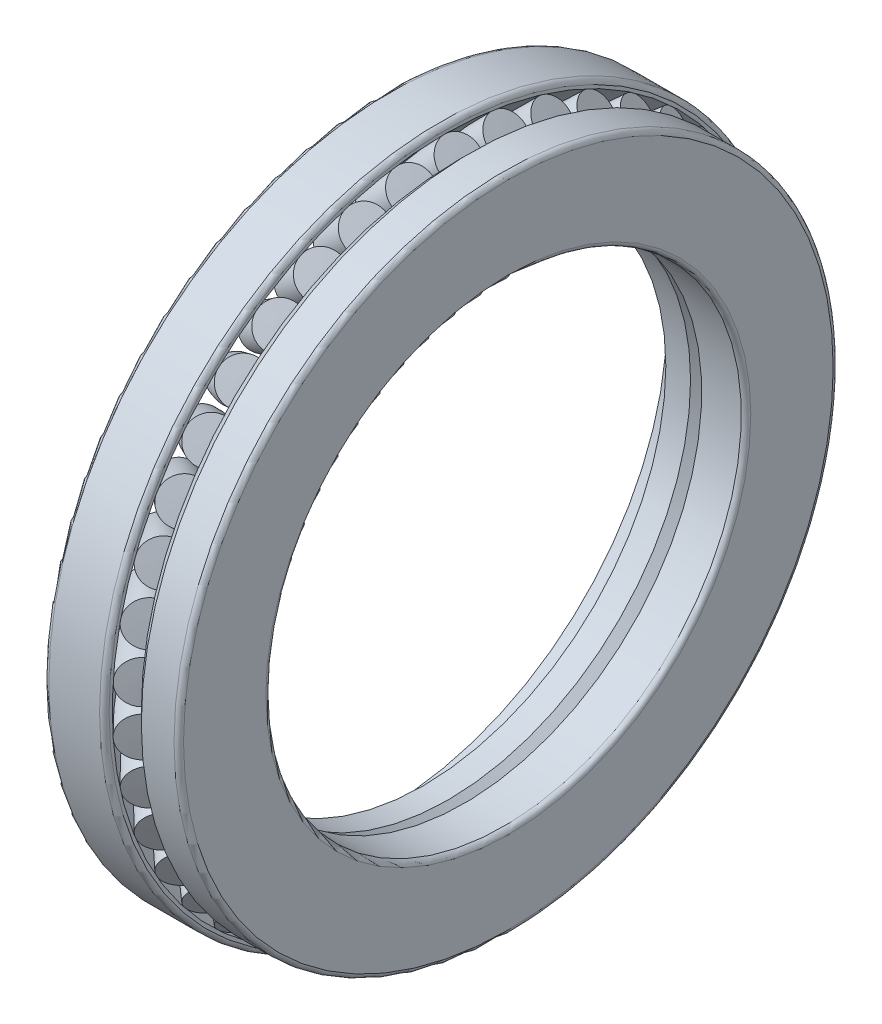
from build123d import *

# Parameters (mm, degrees)
CIRCULAR_PATTERN1_COUNT = 42


with BuildPart() as part:
    # Sketch1 → Revolve1 (revolve)
    with BuildSketch(Plane.XY, mode=Mode.PRIVATE) as revolve1_sk:
        with BuildLine():
            Line((-1, 106), (-1, 105))
            ThreePointArc((-1, 105), (-8.404844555, 97.260372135), (-15.223921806, 89))
            Line((-15.223921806, 89), (-20, 89))
            Line((-20, 89), (-20, 106))
            ThreePointArc((-20, 106), (-19.560660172, 107.060660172), (-18.5, 107.5))
            Line((-18.5, 107.5), (-2.5, 107.5))
            ThreePointArc((-2.5, 107.5), (-1.439339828, 107.060660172), (-1, 106))
        make_face()
    revolve(revolve1_sk.sketch.rotate(Axis((-62.403103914, 0, 0), (1, 0, 0)), 90), axis=Axis((-62.403103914, 0, 0), (1, 0, 0)))


with BuildPart() as body_2:
    # Sketch2 → Revolve2 (revolve)
    with BuildSketch(Plane.XY, mode=Mode.PRIVATE) as revolve2_sk:
        with BuildLine():
            Line((3.596194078, 100.403805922), (-9.239420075, 87.56819177))
            Line((-9.239420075, 87.56819177), (-13.223921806, 91.552693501))
            ThreePointArc((-13.223921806, 91.552693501), (-7.352309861, 98.431585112), (-1.067114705, 104.934761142))
            Line((-1.067114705, 104.934761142), (3.596194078, 100.403805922))
        make_face()
    revolve(revolve2_sk.sketch.rotate(Axis((-9.239420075, 87.56819177, 0), (0.7071067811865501, 0.7071067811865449, 0)), 180), axis=Axis((-9.239420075, 87.56819177, 0), (0.7071067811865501, 0.7071067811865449, 0)))


with BuildPart() as circular_pattern1_1:
    # Circular-Pattern1: pattern copy
    add(body_2.part.rotate(Axis((0, 0, 0), (1, 0, 0)), 1 * 360 / CIRCULAR_PATTERN1_COUNT))


with BuildPart() as circular_pattern1_2:
    # Circular-Pattern1: pattern copy
    add(body_2.part.rotate(Axis((0, 0, 0), (1, 0, 0)), 2 * 360 / CIRCULAR_PATTERN1_COUNT))


with BuildPart() as circular_pattern1_3:
    # Circular-Pattern1: pattern copy
    add(body_2.part.rotate(Axis((0, 0, 0), (1, 0, 0)), 3 * 360 / CIRCULAR_PATTERN1_COUNT))


with BuildPart() as circular_pattern1_4:
    # Circular-Pattern1: pattern copy
    add(body_2.part.rotate(Axis((0, 0, 0), (1, 0, 0)), 4 * 360 / CIRCULAR_PATTERN1_COUNT))


with BuildPart() as circular_pattern1_5:
    # Circular-Pattern1: pattern copy
    add(body_2.part.rotate(Axis((0, 0, 0), (1, 0, 0)), 5 * 360 / CIRCULAR_PATTERN1_COUNT))


with BuildPart() as circular_pattern1_6:
    # Circular-Pattern1: pattern copy
    add(body_2.part.rotate(Axis((0, 0, 0), (1, 0, 0)), 6 * 360 / CIRCULAR_PATTERN1_COUNT))


with BuildPart() as circular_pattern1_7:
    # Circular-Pattern1: pattern copy
    add(body_2.part.rotate(Axis((0, 0, 0), (1, 0, 0)), 7 * 360 / CIRCULAR_PATTERN1_COUNT))


with BuildPart() as circular_pattern1_8:
    # Circular-Pattern1: pattern copy
    add(body_2.part.rotate(Axis((0, 0, 0), (1, 0, 0)), 8 * 360 / CIRCULAR_PATTERN1_COUNT))


with BuildPart() as circular_pattern1_9:
    # Circular-Pattern1: pattern copy
    add(body_2.part.rotate(Axis((0, 0, 0), (1, 0, 0)), 9 * 360 / CIRCULAR_PATTERN1_COUNT))


with BuildPart() as circular_pattern1_10:
    # Circular-Pattern1: pattern copy
    add(body_2.part.rotate(Axis((0, 0, 0), (1, 0, 0)), 10 * 360 / CIRCULAR_PATTERN1_COUNT))


with BuildPart() as circular_pattern1_11:
    # Circular-Pattern1: pattern copy
    add(body_2.part.rotate(Axis((0, 0, 0), (1, 0, 0)), 11 * 360 / CIRCULAR_PATTERN1_COUNT))


with BuildPart() as circular_pattern1_12:
    # Circular-Pattern1: pattern copy
    add(body_2.part.rotate(Axis((0, 0, 0), (1, 0, 0)), 12 * 360 / CIRCULAR_PATTERN1_COUNT))


with BuildPart() as circular_pattern1_13:
    # Circular-Pattern1: pattern copy
    add(body_2.part.rotate(Axis((0, 0, 0), (1, 0, 0)), 13 * 360 / CIRCULAR_PATTERN1_COUNT))


with BuildPart() as circular_pattern1_14:
    # Circular-Pattern1: pattern copy
    add(body_2.part.rotate(Axis((0, 0, 0), (1, 0, 0)), 14 * 360 / CIRCULAR_PATTERN1_COUNT))


with BuildPart() as circular_pattern1_15:
    # Circular-Pattern1: pattern copy
    add(body_2.part.rotate(Axis((0, 0, 0), (1, 0, 0)), 15 * 360 / CIRCULAR_PATTERN1_COUNT))


with BuildPart() as circular_pattern1_16:
    # Circular-Pattern1: pattern copy
    add(body_2.part.rotate(Axis((0, 0, 0), (1, 0, 0)), 16 * 360 / CIRCULAR_PATTERN1_COUNT))


with BuildPart() as circular_pattern1_17:
    # Circular-Pattern1: pattern copy
    add(body_2.part.rotate(Axis((0, 0, 0), (1, 0, 0)), 17 * 360 / CIRCULAR_PATTERN1_COUNT))


with BuildPart() as circular_pattern1_18:
    # Circular-Pattern1: pattern copy
    add(body_2.part.rotate(Axis((0, 0, 0), (1, 0, 0)), 18 * 360 / CIRCULAR_PATTERN1_COUNT))


with BuildPart() as circular_pattern1_19:
    # Circular-Pattern1: pattern copy
    add(body_2.part.rotate(Axis((0, 0, 0), (1, 0, 0)), 19 * 360 / CIRCULAR_PATTERN1_COUNT))


with BuildPart() as circular_pattern1_20:
    # Circular-Pattern1: pattern copy
    add(body_2.part.rotate(Axis((0, 0, 0), (1, 0, 0)), 20 * 360 / CIRCULAR_PATTERN1_COUNT))


with BuildPart() as circular_pattern1_21:
    # Circular-Pattern1: pattern copy
    add(body_2.part.rotate(Axis((0, 0, 0), (1, 0, 0)), 21 * 360 / CIRCULAR_PATTERN1_COUNT))


with BuildPart() as circular_pattern1_22:
    # Circular-Pattern1: pattern copy
    add(body_2.part.rotate(Axis((0, 0, 0), (1, 0, 0)), 22 * 360 / CIRCULAR_PATTERN1_COUNT))


with BuildPart() as circular_pattern1_23:
    # Circular-Pattern1: pattern copy
    add(body_2.part.rotate(Axis((0, 0, 0), (1, 0, 0)), 23 * 360 / CIRCULAR_PATTERN1_COUNT))


with BuildPart() as circular_pattern1_24:
    # Circular-Pattern1: pattern copy
    add(body_2.part.rotate(Axis((0, 0, 0), (1, 0, 0)), 24 * 360 / CIRCULAR_PATTERN1_COUNT))


with BuildPart() as circular_pattern1_25:
    # Circular-Pattern1: pattern copy
    add(body_2.part.rotate(Axis((0, 0, 0), (1, 0, 0)), 25 * 360 / CIRCULAR_PATTERN1_COUNT))


with BuildPart() as circular_pattern1_26:
    # Circular-Pattern1: pattern copy
    add(body_2.part.rotate(Axis((0, 0, 0), (1, 0, 0)), 26 * 360 / CIRCULAR_PATTERN1_COUNT))


with BuildPart() as circular_pattern1_27:
    # Circular-Pattern1: pattern copy
    add(body_2.part.rotate(Axis((0, 0, 0), (1, 0, 0)), 27 * 360 / CIRCULAR_PATTERN1_COUNT))


with BuildPart() as circular_pattern1_28:
    # Circular-Pattern1: pattern copy
    add(body_2.part.rotate(Axis((0, 0, 0), (1, 0, 0)), 28 * 360 / CIRCULAR_PATTERN1_COUNT))


with BuildPart() as circular_pattern1_29:
    # Circular-Pattern1: pattern copy
    add(body_2.part.rotate(Axis((0, 0, 0), (1, 0, 0)), 29 * 360 / CIRCULAR_PATTERN1_COUNT))


with BuildPart() as circular_pattern1_30:
    # Circular-Pattern1: pattern copy
    add(body_2.part.rotate(Axis((0, 0, 0), (1, 0, 0)), 30 * 360 / CIRCULAR_PATTERN1_COUNT))


with BuildPart() as circular_pattern1_31:
    # Circular-Pattern1: pattern copy
    add(body_2.part.rotate(Axis((0, 0, 0), (1, 0, 0)), 31 * 360 / CIRCULAR_PATTERN1_COUNT))


with BuildPart() as circular_pattern1_32:
    # Circular-Pattern1: pattern copy
    add(body_2.part.rotate(Axis((0, 0, 0), (1, 0, 0)), 32 * 360 / CIRCULAR_PATTERN1_COUNT))


with BuildPart() as circular_pattern1_33:
    # Circular-Pattern1: pattern copy
    add(body_2.part.rotate(Axis((0, 0, 0), (1, 0, 0)), 33 * 360 / CIRCULAR_PATTERN1_COUNT))


with BuildPart() as circular_pattern1_34:
    # Circular-Pattern1: pattern copy
    add(body_2.part.rotate(Axis((0, 0, 0), (1, 0, 0)), 34 * 360 / CIRCULAR_PATTERN1_COUNT))


with BuildPart() as circular_pattern1_35:
    # Circular-Pattern1: pattern copy
    add(body_2.part.rotate(Axis((0, 0, 0), (1, 0, 0)), 35 * 360 / CIRCULAR_PATTERN1_COUNT))


with BuildPart() as circular_pattern1_36:
    # Circular-Pattern1: pattern copy
    add(body_2.part.rotate(Axis((0, 0, 0), (1, 0, 0)), 36 * 360 / CIRCULAR_PATTERN1_COUNT))


with BuildPart() as circular_pattern1_37:
    # Circular-Pattern1: pattern copy
    add(body_2.part.rotate(Axis((0, 0, 0), (1, 0, 0)), 37 * 360 / CIRCULAR_PATTERN1_COUNT))


with BuildPart() as circular_pattern1_38:
    # Circular-Pattern1: pattern copy
    add(body_2.part.rotate(Axis((0, 0, 0), (1, 0, 0)), 38 * 360 / CIRCULAR_PATTERN1_COUNT))


with BuildPart() as circular_pattern1_39:
    # Circular-Pattern1: pattern copy
    add(body_2.part.rotate(Axis((0, 0, 0), (1, 0, 0)), 39 * 360 / CIRCULAR_PATTERN1_COUNT))


with BuildPart() as circular_pattern1_40:
    # Circular-Pattern1: pattern copy
    add(body_2.part.rotate(Axis((0, 0, 0), (1, 0, 0)), 40 * 360 / CIRCULAR_PATTERN1_COUNT))


with BuildPart() as circular_pattern1_41:
    # Circular-Pattern1: pattern copy
    add(body_2.part.rotate(Axis((0, 0, 0), (1, 0, 0)), 41 * 360 / CIRCULAR_PATTERN1_COUNT))


with BuildPart() as body_44:
    # Sketch3 → Revolve3 (revolve)
    with BuildSketch(Plane.XY, mode=Mode.PRIVATE) as revolve3_sk:
        with BuildLine():
            Line((-7.807611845, 81.583690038), (-7.807611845, 76.5))
            Line((-7.807611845, 76.5), (0, 76.5))
            Line((0, 76.5), (2.5, 79.041845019))
            Line((2.5, 79.041845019), (5, 75))
            Line((5, 75), (17.5, 75))
            ThreePointArc((17.5, 75), (18.560660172, 75.439339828), (19, 76.5))
            Line((19, 76.5), (19, 102.5))
            ThreePointArc((19, 102.5), (18.560660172, 103.560660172), (17.5, 104))
            Line((17.5, 104), (7.192388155, 104))
            Line((7.192388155, 104), (3.596194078, 100.403805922))
            Line((3.596194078, 100.403805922), (8.192388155, 95.807611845))
            ThreePointArc((8.192388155, 95.807611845), (0.452760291, 88.40276729), (-7.807611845, 81.583690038))
        make_face()
    revolve(revolve3_sk.sketch.rotate(Axis((-62.403103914, 0, 0), (1, 0, 0)), 90), axis=Axis((-62.403103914, 0, 0), (1, 0, 0)))


solid = Compound([part.part, body_2.part, circular_pattern1_1.part, circular_pattern1_2.part, circular_pattern1_3.part, circular_pattern1_4.part, circular_pattern1_5.part, circular_pattern1_6.part, circular_pattern1_7.part, circular_pattern1_8.part, circular_pattern1_9.part, circular_pattern1_10.part, circular_pattern1_11.part, circular_pattern1_12.part, circular_pattern1_13.part, circular_pattern1_14.part, circular_pattern1_15.part, circular_pattern1_16.part, circular_pattern1_17.part, circular_pattern1_18.part, circular_pattern1_19.part, circular_pattern1_20.part, circular_pattern1_21.part, circular_pattern1_22.part, circular_pattern1_23.part, circular_pattern1_24.part, circular_pattern1_25.part, circular_pattern1_26.part, circular_pattern1_27.part, circular_pattern1_28.part, circular_pattern1_29.part, circular_pattern1_30.part, circular_pattern1_31.part, circular_pattern1_32.part, circular_pattern1_33.part, circular_pattern1_34.part, circular_pattern1_35.part, circular_pattern1_36.part, circular_pattern1_37.part, circular_pattern1_38.part, circular_pattern1_39.part, circular_pattern1_40.part, circular_pattern1_41.part, body_44.part])
